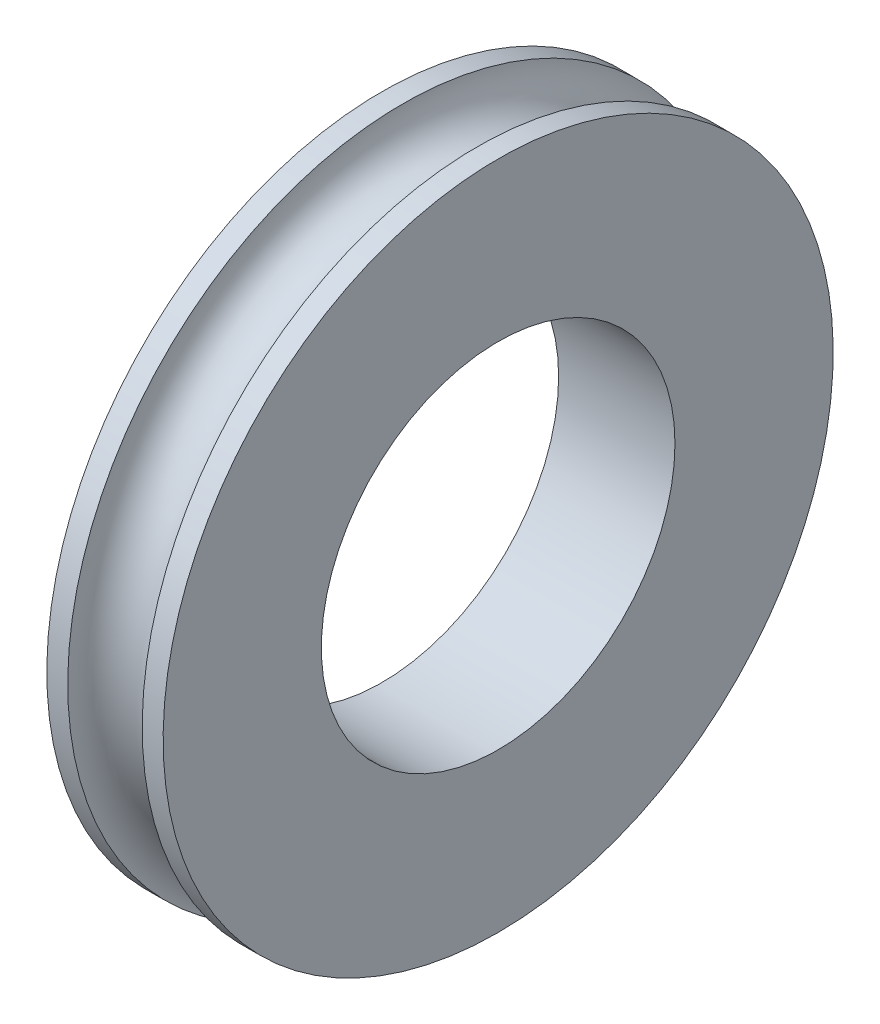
ISO-10303-21;
HEADER;
FILE_DESCRIPTION(('STEP AP214'),'2;1');
FILE_NAME('part.step','',(''),(''),'','','');
FILE_SCHEMA(('AUTOMOTIVE_DESIGN { 1 0 10303 214 1 1 1 1 }'));
ENDSEC;
DATA;
#1=APPLICATION_CONTEXT('core data for automotive mechanical design processes');
#2=APPLICATION_PROTOCOL_DEFINITION('international standard','automotive_design',2000,#1);
#3=PRODUCT_CONTEXT('',#1,'mechanical');
#4=PRODUCT('Part','Part','',(#3));
#5=PRODUCT_RELATED_PRODUCT_CATEGORY('part','',(#4));
#6=PRODUCT_DEFINITION_FORMATION('','',#4);
#7=PRODUCT_DEFINITION_CONTEXT('part definition',#1,'design');
#8=PRODUCT_DEFINITION('design','',#6,#7);
#9=PRODUCT_DEFINITION_SHAPE('','',#8);
#10=(LENGTH_UNIT() NAMED_UNIT(*) SI_UNIT(.MILLI.,.METRE.));
#11=(NAMED_UNIT(*) PLANE_ANGLE_UNIT() SI_UNIT($,.RADIAN.));
#12=(NAMED_UNIT(*) SI_UNIT($,.STERADIAN.) SOLID_ANGLE_UNIT());
#13=UNCERTAINTY_MEASURE_WITH_UNIT(LENGTH_MEASURE(1.E-05),#10,'distance_accuracy_value','');
#14=(GEOMETRIC_REPRESENTATION_CONTEXT(3) GLOBAL_UNCERTAINTY_ASSIGNED_CONTEXT((#13)) GLOBAL_UNIT_ASSIGNED_CONTEXT((#10,
#11,#12)) REPRESENTATION_CONTEXT('',''));
#15=CARTESIAN_POINT('',(0.,0.,0.));
#16=DIRECTION('',(0.,0.,1.));
#17=DIRECTION('',(1.,0.,0.));
#18=AXIS2_PLACEMENT_3D('',#15,#16,#17);
#19=CARTESIAN_POINT('',(-3.125,0.,0.));
#20=DIRECTION('',(1.,0.,0.));
#21=DIRECTION('',(0.,1.,0.));
#22=AXIS2_PLACEMENT_3D('',#19,#20,#21);
#23=PLANE('',#22);
#24=CARTESIAN_POINT('',(-3.12500000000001,0.,0.));
#25=DIRECTION('',(1.,0.,0.));
#26=DIRECTION('',(0.,0.,-1.));
#27=AXIS2_PLACEMENT_3D('',#24,#25,#26);
#28=CIRCLE('',#27,9.5);
#29=CARTESIAN_POINT('',(-3.12500000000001,0.,-9.5));
#30=VERTEX_POINT('',#29);
#31=EDGE_CURVE('E52',#30,#30,#28,.T.);
#32=ORIENTED_EDGE('',*,*,#31,.T.);
#33=EDGE_LOOP('',(#32));
#34=FACE_BOUND('',#33,.T.);
#35=CARTESIAN_POINT('',(-3.125,0.,0.));
#36=DIRECTION('',(-1.,0.,0.));
#37=DIRECTION('',(0.,-1.,0.));
#38=AXIS2_PLACEMENT_3D('',#35,#36,#37);
#39=CIRCLE('',#38,18.);
#40=CARTESIAN_POINT('',(-3.12499999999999,-18.,0.));
#41=VERTEX_POINT('',#40);
#42=EDGE_CURVE('E47',#41,#41,#39,.T.);
#43=ORIENTED_EDGE('',*,*,#42,.T.);
#44=EDGE_LOOP('',(#43));
#45=FACE_BOUND('',#44,.T.);
#46=ADVANCED_FACE('F33',(#34,#45),#23,.F.);
#47=CARTESIAN_POINT('',(3.125,0.,0.));
#48=DIRECTION('',(-1.,0.,0.));
#49=DIRECTION('',(0.,-1.,0.));
#50=AXIS2_PLACEMENT_3D('',#47,#48,#49);
#51=PLANE('',#50);
#52=CARTESIAN_POINT('',(3.125,0.,0.));
#53=DIRECTION('',(1.,0.,0.));
#54=DIRECTION('',(0.,0.,-1.));
#55=AXIS2_PLACEMENT_3D('',#52,#53,#54);
#56=CIRCLE('',#55,9.5);
#57=CARTESIAN_POINT('',(3.125,0.,-9.5));
#58=VERTEX_POINT('',#57);
#59=EDGE_CURVE('E55',#58,#58,#56,.T.);
#60=ORIENTED_EDGE('',*,*,#59,.F.);
#61=EDGE_LOOP('',(#60));
#62=FACE_BOUND('',#61,.T.);
#63=CARTESIAN_POINT('',(3.125,0.,0.));
#64=DIRECTION('',(-1.,0.,0.));
#65=DIRECTION('',(0.,-1.,0.));
#66=AXIS2_PLACEMENT_3D('',#63,#64,#65);
#67=CIRCLE('',#66,18.);
#68=CARTESIAN_POINT('',(3.12500000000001,-18.,0.));
#69=VERTEX_POINT('',#68);
#70=EDGE_CURVE('E10',#69,#69,#67,.T.);
#71=ORIENTED_EDGE('',*,*,#70,.F.);
#72=EDGE_LOOP('',(#71));
#73=FACE_BOUND('',#72,.T.);
#74=ADVANCED_FACE('F61',(#62,#73),#51,.F.);
#75=CARTESIAN_POINT('',(-22.9962185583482,0.,0.));
#76=DIRECTION('',(-1.,0.,0.));
#77=DIRECTION('',(0.,-1.,0.));
#78=AXIS2_PLACEMENT_3D('',#75,#76,#77);
#79=CYLINDRICAL_SURFACE('',#78,18.);
#80=CARTESIAN_POINT('',(2.00000000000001,0.,0.));
#81=DIRECTION('',(-1.,0.,0.));
#82=DIRECTION('',(0.,-1.,0.));
#83=AXIS2_PLACEMENT_3D('',#80,#81,#82);
#84=CIRCLE('',#83,18.);
#85=CARTESIAN_POINT('',(2.00000000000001,-18.,0.));
#86=VERTEX_POINT('',#85);
#87=EDGE_CURVE('E39',#86,#86,#84,.T.);
#88=ORIENTED_EDGE('',*,*,#87,.F.);
#89=EDGE_LOOP('',(#88));
#90=FACE_BOUND('',#89,.T.);
#91=ORIENTED_EDGE('',*,*,#70,.T.);
#92=EDGE_LOOP('',(#91));
#93=FACE_BOUND('',#92,.T.);
#94=ADVANCED_FACE('F64',(#90,#93),#79,.T.);
#95=CARTESIAN_POINT('',(0.,0.,0.));
#96=DIRECTION('',(-1.,0.,0.));
#97=DIRECTION('',(0.,-1.,0.));
#98=AXIS2_PLACEMENT_3D('',#95,#96,#97);
#99=TOROIDAL_SURFACE('',#98,18.,2.);
#100=CARTESIAN_POINT('',(-2.,0.,0.));
#101=DIRECTION('',(-1.,0.,0.));
#102=DIRECTION('',(0.,-1.,0.));
#103=AXIS2_PLACEMENT_3D('',#100,#101,#102);
#104=CIRCLE('',#103,18.);
#105=CARTESIAN_POINT('',(-1.99999999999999,-18.,0.));
#106=VERTEX_POINT('',#105);
#107=EDGE_CURVE('E43',#106,#106,#104,.T.);
#108=ORIENTED_EDGE('',*,*,#107,.F.);
#109=EDGE_LOOP('',(#108));
#110=FACE_BOUND('',#109,.T.);
#111=ORIENTED_EDGE('',*,*,#87,.T.);
#112=EDGE_LOOP('',(#111));
#113=FACE_BOUND('',#112,.T.);
#114=ADVANCED_FACE('F69',(#110,#113),#99,.F.);
#115=CARTESIAN_POINT('',(-22.9962185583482,0.,0.));
#116=DIRECTION('',(-1.,0.,0.));
#117=DIRECTION('',(0.,-1.,0.));
#118=AXIS2_PLACEMENT_3D('',#115,#116,#117);
#119=CYLINDRICAL_SURFACE('',#118,18.);
#120=ORIENTED_EDGE('',*,*,#42,.F.);
#121=EDGE_LOOP('',(#120));
#122=FACE_BOUND('',#121,.T.);
#123=ORIENTED_EDGE('',*,*,#107,.T.);
#124=EDGE_LOOP('',(#123));
#125=FACE_BOUND('',#124,.T.);
#126=ADVANCED_FACE('F76',(#122,#125),#119,.T.);
#127=CARTESIAN_POINT('',(3.125,0.,0.));
#128=DIRECTION('',(1.,0.,0.));
#129=DIRECTION('',(0.,0.,-1.));
#130=AXIS2_PLACEMENT_3D('',#127,#128,#129);
#131=CYLINDRICAL_SURFACE('',#130,9.5);
#132=ORIENTED_EDGE('',*,*,#31,.F.);
#133=EDGE_LOOP('',(#132));
#134=FACE_BOUND('',#133,.T.);
#135=ORIENTED_EDGE('',*,*,#59,.T.);
#136=EDGE_LOOP('',(#135));
#137=FACE_BOUND('',#136,.T.);
#138=ADVANCED_FACE('F59',(#134,#137),#131,.F.);
#139=CLOSED_SHELL('',(#46,#74,#94,#114,#126,#138));
#140=MANIFOLD_SOLID_BREP('B2',#139);
#141=ADVANCED_BREP_SHAPE_REPRESENTATION('',(#18,#140),#14);
#142=SHAPE_DEFINITION_REPRESENTATION(#9,#141);
ENDSEC;
END-ISO-10303-21;
